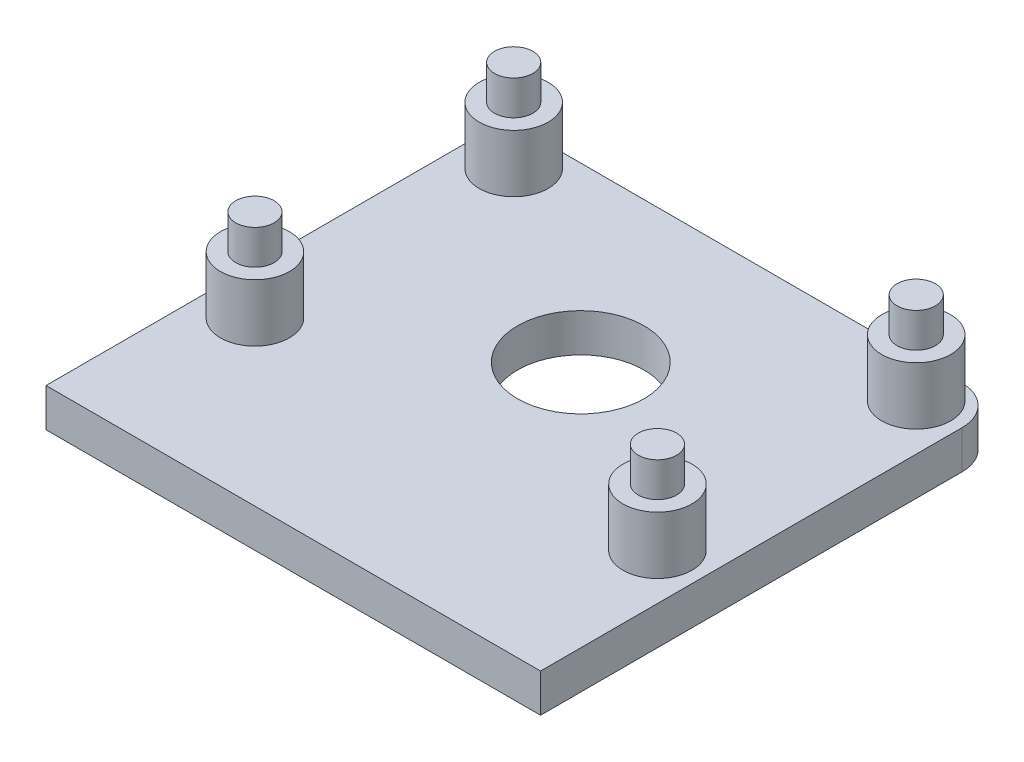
ISO-10303-21;
HEADER;
FILE_DESCRIPTION(('STEP AP214'),'2;1');
FILE_NAME('part.step','',(''),(''),'','','');
FILE_SCHEMA(('AUTOMOTIVE_DESIGN { 1 0 10303 214 1 1 1 1 }'));
ENDSEC;
DATA;
#1=APPLICATION_CONTEXT('core data for automotive mechanical design processes');
#2=APPLICATION_PROTOCOL_DEFINITION('international standard','automotive_design',2000,#1);
#3=PRODUCT_CONTEXT('',#1,'mechanical');
#4=PRODUCT('Part','Part','',(#3));
#5=PRODUCT_RELATED_PRODUCT_CATEGORY('part','',(#4));
#6=PRODUCT_DEFINITION_FORMATION('','',#4);
#7=PRODUCT_DEFINITION_CONTEXT('part definition',#1,'design');
#8=PRODUCT_DEFINITION('design','',#6,#7);
#9=PRODUCT_DEFINITION_SHAPE('','',#8);
#10=(LENGTH_UNIT() NAMED_UNIT(*) SI_UNIT(.MILLI.,.METRE.));
#11=(NAMED_UNIT(*) PLANE_ANGLE_UNIT() SI_UNIT($,.RADIAN.));
#12=(NAMED_UNIT(*) SI_UNIT($,.STERADIAN.) SOLID_ANGLE_UNIT());
#13=UNCERTAINTY_MEASURE_WITH_UNIT(LENGTH_MEASURE(1.E-05),#10,'distance_accuracy_value','');
#14=(GEOMETRIC_REPRESENTATION_CONTEXT(3) GLOBAL_UNCERTAINTY_ASSIGNED_CONTEXT((#13)) GLOBAL_UNIT_ASSIGNED_CONTEXT((#10,
#11,#12)) REPRESENTATION_CONTEXT('',''));
#15=CARTESIAN_POINT('',(0.,0.,0.));
#16=DIRECTION('',(0.,0.,1.));
#17=DIRECTION('',(1.,0.,0.));
#18=AXIS2_PLACEMENT_3D('',#15,#16,#17);
#19=CARTESIAN_POINT('',(0.,2.,0.));
#20=DIRECTION('',(0.,1.,0.));
#21=DIRECTION('',(0.,0.,1.));
#22=AXIS2_PLACEMENT_3D('',#19,#20,#21);
#23=PLANE('',#22);
#24=CARTESIAN_POINT('',(9.52951453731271,2.,0.378221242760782));
#25=DIRECTION('',(0.,1.,0.));
#26=DIRECTION('',(0.,0.,1.));
#27=AXIS2_PLACEMENT_3D('',#24,#25,#26);
#28=CIRCLE('',#27,1.8);
#29=CARTESIAN_POINT('',(9.52951453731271,2.,2.17822124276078));
#30=VERTEX_POINT('',#29);
#31=EDGE_CURVE('E160',#30,#30,#28,.T.);
#32=ORIENTED_EDGE('',*,*,#31,.F.);
#33=EDGE_LOOP('',(#32));
#34=FACE_BOUND('',#33,.T.);
#35=CARTESIAN_POINT('',(-11.4704854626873,2.,0.378221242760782));
#36=DIRECTION('',(0.,1.,0.));
#37=DIRECTION('',(0.,0.,1.));
#38=AXIS2_PLACEMENT_3D('',#35,#36,#37);
#39=CIRCLE('',#38,1.8);
#40=CARTESIAN_POINT('',(-11.4704854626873,2.,2.17822124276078));
#41=VERTEX_POINT('',#40);
#42=EDGE_CURVE('E153',#41,#41,#39,.T.);
#43=ORIENTED_EDGE('',*,*,#42,.F.);
#44=EDGE_LOOP('',(#43));
#45=FACE_BOUND('',#44,.T.);
#46=CARTESIAN_POINT('',(9.52951453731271,2.,-13.1217787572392));
#47=DIRECTION('',(0.,1.,0.));
#48=DIRECTION('',(0.,0.,1.));
#49=AXIS2_PLACEMENT_3D('',#46,#47,#48);
#50=CIRCLE('',#49,1.8);
#51=CARTESIAN_POINT('',(9.52951453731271,2.,-11.3217787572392));
#52=VERTEX_POINT('',#51);
#53=EDGE_CURVE('E146',#52,#52,#50,.T.);
#54=ORIENTED_EDGE('',*,*,#53,.F.);
#55=EDGE_LOOP('',(#54));
#56=FACE_BOUND('',#55,.T.);
#57=CARTESIAN_POINT('',(-11.4704854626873,2.,-13.1217787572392));
#58=DIRECTION('',(0.,1.,0.));
#59=DIRECTION('',(0.,0.,1.));
#60=AXIS2_PLACEMENT_3D('',#57,#58,#59);
#61=CIRCLE('',#60,1.8);
#62=CARTESIAN_POINT('',(-11.4704854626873,2.,-11.3217787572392));
#63=VERTEX_POINT('',#62);
#64=EDGE_CURVE('E142',#63,#63,#61,.T.);
#65=ORIENTED_EDGE('',*,*,#64,.F.);
#66=EDGE_LOOP('',(#65));
#67=FACE_BOUND('',#66,.T.);
#68=DIRECTION('',(0.,0.,-1.));
#69=VECTOR('',#68,1.);
#70=CARTESIAN_POINT('',(11.9295145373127,2.,-15.1217787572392));
#71=LINE('',#70,#69);
#72=CARTESIAN_POINT('',(11.9295145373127,2.,8.87822124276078));
#73=VERTEX_POINT('',#72);
#74=CARTESIAN_POINT('',(11.9295145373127,2.,-13.1217787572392));
#75=VERTEX_POINT('',#74);
#76=EDGE_CURVE('E122',#73,#75,#71,.T.);
#77=ORIENTED_EDGE('',*,*,#76,.T.);
#78=CARTESIAN_POINT('',(9.92951453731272,2.,-13.1217787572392));
#79=DIRECTION('',(0.,1.,0.));
#80=DIRECTION('',(0.,0.,1.));
#81=AXIS2_PLACEMENT_3D('',#78,#79,#80);
#82=CIRCLE('',#81,2.);
#83=CARTESIAN_POINT('',(9.92951453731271,2.,-15.1217787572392));
#84=VERTEX_POINT('',#83);
#85=EDGE_CURVE('E42',#75,#84,#82,.T.);
#86=ORIENTED_EDGE('',*,*,#85,.T.);
#87=DIRECTION('',(-1.,0.,0.));
#88=VECTOR('',#87,1.);
#89=CARTESIAN_POINT('',(-13.8704854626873,2.,-15.1217787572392));
#90=LINE('',#89,#88);
#91=CARTESIAN_POINT('',(-11.8704854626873,2.,-15.1217787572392));
#92=VERTEX_POINT('',#91);
#93=EDGE_CURVE('E96',#84,#92,#90,.T.);
#94=ORIENTED_EDGE('',*,*,#93,.T.);
#95=CARTESIAN_POINT('',(-11.8704854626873,2.,-13.1217787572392));
#96=DIRECTION('',(0.,1.,0.));
#97=DIRECTION('',(0.,0.,1.));
#98=AXIS2_PLACEMENT_3D('',#95,#96,#97);
#99=CIRCLE('',#98,2.);
#100=CARTESIAN_POINT('',(-13.8704854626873,2.,-13.1217787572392));
#101=VERTEX_POINT('',#100);
#102=EDGE_CURVE('E50',#92,#101,#99,.T.);
#103=ORIENTED_EDGE('',*,*,#102,.T.);
#104=DIRECTION('',(0.,0.,1.));
#105=VECTOR('',#104,1.);
#106=CARTESIAN_POINT('',(-13.8704854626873,2.,-15.1217787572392));
#107=LINE('',#106,#105);
#108=CARTESIAN_POINT('',(-13.8704854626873,2.,8.87822124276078));
#109=VERTEX_POINT('',#108);
#110=EDGE_CURVE('E88',#101,#109,#107,.T.);
#111=ORIENTED_EDGE('',*,*,#110,.T.);
#112=DIRECTION('',(1.,0.,0.));
#113=VECTOR('',#112,1.);
#114=CARTESIAN_POINT('',(-13.8704854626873,2.,8.87822124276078));
#115=LINE('',#114,#113);
#116=EDGE_CURVE('E92',#109,#73,#115,.T.);
#117=ORIENTED_EDGE('',*,*,#116,.T.);
#118=EDGE_LOOP('',(#77,#86,#94,#103,#111,#117));
#119=FACE_BOUND('',#118,.T.);
#120=CARTESIAN_POINT('',(-0.970485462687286,2.,-6.12177875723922));
#121=DIRECTION('',(0.,1.,0.));
#122=DIRECTION('',(0.,0.,1.));
#123=AXIS2_PLACEMENT_3D('',#120,#121,#122);
#124=CIRCLE('',#123,3.3);
#125=CARTESIAN_POINT('',(-0.970485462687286,2.,-2.82177875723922));
#126=VERTEX_POINT('',#125);
#127=EDGE_CURVE('E117',#126,#126,#124,.T.);
#128=ORIENTED_EDGE('',*,*,#127,.F.);
#129=EDGE_LOOP('',(#128));
#130=FACE_BOUND('',#129,.T.);
#131=ADVANCED_FACE('F33',(#34,#45,#56,#67,#119,#130),#23,.T.);
#132=CARTESIAN_POINT('',(0.,0.,0.));
#133=DIRECTION('',(0.,1.,0.));
#134=DIRECTION('',(0.,0.,1.));
#135=AXIS2_PLACEMENT_3D('',#132,#133,#134);
#136=PLANE('',#135);
#137=DIRECTION('',(-1.,0.,0.));
#138=VECTOR('',#137,1.);
#139=CARTESIAN_POINT('',(-13.8704854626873,0.,-15.1217787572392));
#140=LINE('',#139,#138);
#141=CARTESIAN_POINT('',(9.92951453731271,0.,-15.1217787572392));
#142=VERTEX_POINT('',#141);
#143=CARTESIAN_POINT('',(-11.8704854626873,0.,-15.1217787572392));
#144=VERTEX_POINT('',#143);
#145=EDGE_CURVE('E116',#142,#144,#140,.T.);
#146=ORIENTED_EDGE('',*,*,#145,.F.);
#147=CARTESIAN_POINT('',(9.92951453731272,0.,-13.1217787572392));
#148=DIRECTION('',(0.,1.,0.));
#149=DIRECTION('',(0.,0.,1.));
#150=AXIS2_PLACEMENT_3D('',#147,#148,#149);
#151=CIRCLE('',#150,2.);
#152=CARTESIAN_POINT('',(11.9295145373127,0.,-13.1217787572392));
#153=VERTEX_POINT('',#152);
#154=EDGE_CURVE('E130',#142,#153,#151,.F.);
#155=ORIENTED_EDGE('',*,*,#154,.T.);
#156=DIRECTION('',(0.,0.,-1.));
#157=VECTOR('',#156,1.);
#158=CARTESIAN_POINT('',(11.9295145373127,0.,-15.1217787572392));
#159=LINE('',#158,#157);
#160=CARTESIAN_POINT('',(11.9295145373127,0.,8.87822124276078));
#161=VERTEX_POINT('',#160);
#162=EDGE_CURVE('E114',#161,#153,#159,.T.);
#163=ORIENTED_EDGE('',*,*,#162,.F.);
#164=DIRECTION('',(1.,0.,0.));
#165=VECTOR('',#164,1.);
#166=CARTESIAN_POINT('',(-13.8704854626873,0.,8.87822124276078));
#167=LINE('',#166,#165);
#168=CARTESIAN_POINT('',(-13.8704854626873,0.,8.87822124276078));
#169=VERTEX_POINT('',#168);
#170=EDGE_CURVE('E121',#169,#161,#167,.T.);
#171=ORIENTED_EDGE('',*,*,#170,.F.);
#172=DIRECTION('',(0.,0.,1.));
#173=VECTOR('',#172,1.);
#174=CARTESIAN_POINT('',(-13.8704854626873,0.,-15.1217787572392));
#175=LINE('',#174,#173);
#176=CARTESIAN_POINT('',(-13.8704854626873,0.,-13.1217787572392));
#177=VERTEX_POINT('',#176);
#178=EDGE_CURVE('E102',#177,#169,#175,.T.);
#179=ORIENTED_EDGE('',*,*,#178,.F.);
#180=CARTESIAN_POINT('',(-11.8704854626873,0.,-13.1217787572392));
#181=DIRECTION('',(0.,1.,0.));
#182=DIRECTION('',(0.,0.,1.));
#183=AXIS2_PLACEMENT_3D('',#180,#181,#182);
#184=CIRCLE('',#183,2.);
#185=EDGE_CURVE('E128',#177,#144,#184,.F.);
#186=ORIENTED_EDGE('',*,*,#185,.T.);
#187=EDGE_LOOP('',(#146,#155,#163,#171,#179,#186));
#188=FACE_BOUND('',#187,.T.);
#189=CARTESIAN_POINT('',(-0.970485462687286,0.,-6.12177875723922));
#190=DIRECTION('',(0.,1.,0.));
#191=DIRECTION('',(0.,0.,1.));
#192=AXIS2_PLACEMENT_3D('',#189,#190,#191);
#193=CIRCLE('',#192,3.3);
#194=CARTESIAN_POINT('',(-0.970485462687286,0.,-2.82177875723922));
#195=VERTEX_POINT('',#194);
#196=EDGE_CURVE('E180',#195,#195,#193,.T.);
#197=ORIENTED_EDGE('',*,*,#196,.T.);
#198=EDGE_LOOP('',(#197));
#199=FACE_BOUND('',#198,.T.);
#200=ADVANCED_FACE('F193',(#188,#199),#136,.F.);
#201=CARTESIAN_POINT('',(11.9295145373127,2.,-15.1217787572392));
#202=DIRECTION('',(-1.,0.,0.));
#203=DIRECTION('',(0.,0.,1.));
#204=AXIS2_PLACEMENT_3D('',#201,#202,#203);
#205=PLANE('',#204);
#206=ORIENTED_EDGE('',*,*,#162,.T.);
#207=DIRECTION('',(0.,-1.,0.));
#208=VECTOR('',#207,1.);
#209=CARTESIAN_POINT('',(11.9295145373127,2.,-13.1217787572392));
#210=LINE('',#209,#208);
#211=EDGE_CURVE('E58',#153,#75,#210,.F.);
#212=ORIENTED_EDGE('',*,*,#211,.T.);
#213=ORIENTED_EDGE('',*,*,#76,.F.);
#214=DIRECTION('',(0.,-1.,0.));
#215=VECTOR('',#214,1.);
#216=CARTESIAN_POINT('',(11.9295145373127,2.,8.87822124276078));
#217=LINE('',#216,#215);
#218=EDGE_CURVE('E106',#73,#161,#217,.T.);
#219=ORIENTED_EDGE('',*,*,#218,.T.);
#220=EDGE_LOOP('',(#206,#212,#213,#219));
#221=FACE_BOUND('',#220,.T.);
#222=ADVANCED_FACE('F196',(#221),#205,.F.);
#223=CARTESIAN_POINT('',(-13.8704854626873,2.,-15.1217787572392));
#224=DIRECTION('',(0.,0.,1.));
#225=DIRECTION('',(1.,0.,0.));
#226=AXIS2_PLACEMENT_3D('',#223,#224,#225);
#227=PLANE('',#226);
#228=ORIENTED_EDGE('',*,*,#93,.F.);
#229=DIRECTION('',(0.,-1.,0.));
#230=VECTOR('',#229,1.);
#231=CARTESIAN_POINT('',(9.92951453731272,2.,-15.1217787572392));
#232=LINE('',#231,#230);
#233=EDGE_CURVE('E125',#84,#142,#232,.T.);
#234=ORIENTED_EDGE('',*,*,#233,.T.);
#235=ORIENTED_EDGE('',*,*,#145,.T.);
#236=DIRECTION('',(0.,-1.,0.));
#237=VECTOR('',#236,1.);
#238=CARTESIAN_POINT('',(-11.8704854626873,2.,-15.1217787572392));
#239=LINE('',#238,#237);
#240=EDGE_CURVE('E105',#144,#92,#239,.F.);
#241=ORIENTED_EDGE('',*,*,#240,.T.);
#242=EDGE_LOOP('',(#228,#234,#235,#241));
#243=FACE_BOUND('',#242,.T.);
#244=ADVANCED_FACE('F199',(#243),#227,.F.);
#245=CARTESIAN_POINT('',(-13.8704854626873,2.,-15.1217787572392));
#246=DIRECTION('',(1.,0.,0.));
#247=DIRECTION('',(0.,0.,-1.));
#248=AXIS2_PLACEMENT_3D('',#245,#246,#247);
#249=PLANE('',#248);
#250=ORIENTED_EDGE('',*,*,#110,.F.);
#251=DIRECTION('',(0.,-1.,0.));
#252=VECTOR('',#251,1.);
#253=CARTESIAN_POINT('',(-13.8704854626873,2.,-13.1217787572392));
#254=LINE('',#253,#252);
#255=EDGE_CURVE('E11',#101,#177,#254,.T.);
#256=ORIENTED_EDGE('',*,*,#255,.T.);
#257=ORIENTED_EDGE('',*,*,#178,.T.);
#258=DIRECTION('',(0.,-1.,0.));
#259=VECTOR('',#258,1.);
#260=CARTESIAN_POINT('',(-13.8704854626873,2.,8.87822124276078));
#261=LINE('',#260,#259);
#262=EDGE_CURVE('E99',#109,#169,#261,.T.);
#263=ORIENTED_EDGE('',*,*,#262,.F.);
#264=EDGE_LOOP('',(#250,#256,#257,#263));
#265=FACE_BOUND('',#264,.T.);
#266=ADVANCED_FACE('F100',(#265),#249,.F.);
#267=CARTESIAN_POINT('',(-13.8704854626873,2.,8.87822124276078));
#268=DIRECTION('',(0.,0.,-1.));
#269=DIRECTION('',(-1.,0.,0.));
#270=AXIS2_PLACEMENT_3D('',#267,#268,#269);
#271=PLANE('',#270);
#272=ORIENTED_EDGE('',*,*,#170,.T.);
#273=ORIENTED_EDGE('',*,*,#218,.F.);
#274=ORIENTED_EDGE('',*,*,#116,.F.);
#275=ORIENTED_EDGE('',*,*,#262,.T.);
#276=EDGE_LOOP('',(#272,#273,#274,#275));
#277=FACE_BOUND('',#276,.T.);
#278=ADVANCED_FACE('F108',(#277),#271,.F.);
#279=CARTESIAN_POINT('',(-0.970485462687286,2.,-6.12177875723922));
#280=DIRECTION('',(0.,-1.,0.));
#281=DIRECTION('',(0.,0.,-1.));
#282=AXIS2_PLACEMENT_3D('',#279,#280,#281);
#283=CYLINDRICAL_SURFACE('',#282,3.3);
#284=ORIENTED_EDGE('',*,*,#127,.T.);
#285=EDGE_LOOP('',(#284));
#286=FACE_BOUND('',#285,.T.);
#287=ORIENTED_EDGE('',*,*,#196,.F.);
#288=EDGE_LOOP('',(#287));
#289=FACE_BOUND('',#288,.T.);
#290=ADVANCED_FACE('F220',(#286,#289),#283,.F.);
#291=CARTESIAN_POINT('',(9.92951453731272,2.,-13.1217787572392));
#292=DIRECTION('',(0.,-1.,0.));
#293=DIRECTION('',(0.,0.,-1.));
#294=AXIS2_PLACEMENT_3D('',#291,#292,#293);
#295=CYLINDRICAL_SURFACE('',#294,2.);
#296=ORIENTED_EDGE('',*,*,#85,.F.);
#297=ORIENTED_EDGE('',*,*,#211,.F.);
#298=ORIENTED_EDGE('',*,*,#154,.F.);
#299=ORIENTED_EDGE('',*,*,#233,.F.);
#300=EDGE_LOOP('',(#296,#297,#298,#299));
#301=FACE_BOUND('',#300,.T.);
#302=ADVANCED_FACE('F198',(#301),#295,.T.);
#303=CARTESIAN_POINT('',(-11.8704854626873,2.,-13.1217787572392));
#304=DIRECTION('',(0.,-1.,0.));
#305=DIRECTION('',(0.,0.,-1.));
#306=AXIS2_PLACEMENT_3D('',#303,#304,#305);
#307=CYLINDRICAL_SURFACE('',#306,2.);
#308=ORIENTED_EDGE('',*,*,#102,.F.);
#309=ORIENTED_EDGE('',*,*,#240,.F.);
#310=ORIENTED_EDGE('',*,*,#185,.F.);
#311=ORIENTED_EDGE('',*,*,#255,.F.);
#312=EDGE_LOOP('',(#308,#309,#310,#311));
#313=FACE_BOUND('',#312,.T.);
#314=ADVANCED_FACE('F35',(#313),#307,.T.);
#315=CARTESIAN_POINT('',(-11.4704854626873,5.,-13.1217787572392));
#316=DIRECTION('',(0.,-1.,0.));
#317=DIRECTION('',(0.,0.,-1.));
#318=AXIS2_PLACEMENT_3D('',#315,#316,#317);
#319=CYLINDRICAL_SURFACE('',#318,1.8);
#320=CARTESIAN_POINT('',(-11.4704854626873,5.,-13.1217787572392));
#321=DIRECTION('',(0.,1.,0.));
#322=DIRECTION('',(0.,0.,1.));
#323=AXIS2_PLACEMENT_3D('',#320,#321,#322);
#324=CIRCLE('',#323,1.8);
#325=CARTESIAN_POINT('',(-11.4704854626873,5.,-11.3217787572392));
#326=VERTEX_POINT('',#325);
#327=EDGE_CURVE('E139',#326,#326,#324,.T.);
#328=ORIENTED_EDGE('',*,*,#327,.F.);
#329=EDGE_LOOP('',(#328));
#330=FACE_BOUND('',#329,.T.);
#331=ORIENTED_EDGE('',*,*,#64,.T.);
#332=EDGE_LOOP('',(#331));
#333=FACE_BOUND('',#332,.T.);
#334=ADVANCED_FACE('F239',(#330,#333),#319,.T.);
#335=CARTESIAN_POINT('',(-11.4704854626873,5.,-13.1217787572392));
#336=DIRECTION('',(0.,1.,0.));
#337=DIRECTION('',(0.,0.,1.));
#338=AXIS2_PLACEMENT_3D('',#335,#336,#337);
#339=PLANE('',#338);
#340=CARTESIAN_POINT('',(-11.4704854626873,5.,-13.1217787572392));
#341=DIRECTION('',(0.,1.,0.));
#342=DIRECTION('',(0.,0.,1.));
#343=AXIS2_PLACEMENT_3D('',#340,#341,#342);
#344=CIRCLE('',#343,1.);
#345=CARTESIAN_POINT('',(-11.4704854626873,5.,-12.1217787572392));
#346=VERTEX_POINT('',#345);
#347=EDGE_CURVE('E135',#346,#346,#344,.T.);
#348=ORIENTED_EDGE('',*,*,#347,.F.);
#349=EDGE_LOOP('',(#348));
#350=FACE_BOUND('',#349,.T.);
#351=ORIENTED_EDGE('',*,*,#327,.T.);
#352=EDGE_LOOP('',(#351));
#353=FACE_BOUND('',#352,.T.);
#354=ADVANCED_FACE('F242',(#350,#353),#339,.T.);
#355=CARTESIAN_POINT('',(-11.4704854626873,6.8,-13.1217787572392));
#356=DIRECTION('',(0.,1.,0.));
#357=DIRECTION('',(0.,0.,1.));
#358=AXIS2_PLACEMENT_3D('',#355,#356,#357);
#359=PLANE('',#358);
#360=CARTESIAN_POINT('',(-11.4704854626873,6.8,-13.1217787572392));
#361=DIRECTION('',(0.,1.,0.));
#362=DIRECTION('',(0.,0.,1.));
#363=AXIS2_PLACEMENT_3D('',#360,#361,#362);
#364=CIRCLE('',#363,1.);
#365=CARTESIAN_POINT('',(-11.4704854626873,6.8,-12.1217787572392));
#366=VERTEX_POINT('',#365);
#367=EDGE_CURVE('E177',#366,#366,#364,.T.);
#368=ORIENTED_EDGE('',*,*,#367,.T.);
#369=EDGE_LOOP('',(#368));
#370=FACE_BOUND('',#369,.T.);
#371=ADVANCED_FACE('F247',(#370),#359,.T.);
#372=CARTESIAN_POINT('',(-11.4704854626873,6.8,-13.1217787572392));
#373=DIRECTION('',(0.,-1.,0.));
#374=DIRECTION('',(0.,0.,-1.));
#375=AXIS2_PLACEMENT_3D('',#372,#373,#374);
#376=CYLINDRICAL_SURFACE('',#375,1.);
#377=ORIENTED_EDGE('',*,*,#347,.T.);
#378=EDGE_LOOP('',(#377));
#379=FACE_BOUND('',#378,.T.);
#380=ORIENTED_EDGE('',*,*,#367,.F.);
#381=EDGE_LOOP('',(#380));
#382=FACE_BOUND('',#381,.T.);
#383=ADVANCED_FACE('F282',(#379,#382),#376,.T.);
#384=CARTESIAN_POINT('',(9.52951453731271,5.,-13.1217787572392));
#385=DIRECTION('',(0.,-1.,0.));
#386=DIRECTION('',(0.,0.,-1.));
#387=AXIS2_PLACEMENT_3D('',#384,#385,#386);
#388=CYLINDRICAL_SURFACE('',#387,1.8);
#389=CARTESIAN_POINT('',(9.52951453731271,5.,-13.1217787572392));
#390=DIRECTION('',(0.,1.,0.));
#391=DIRECTION('',(0.,0.,1.));
#392=AXIS2_PLACEMENT_3D('',#389,#390,#391);
#393=CIRCLE('',#392,1.8);
#394=CARTESIAN_POINT('',(9.52951453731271,5.,-11.3217787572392));
#395=VERTEX_POINT('',#394);
#396=EDGE_CURVE('E143',#395,#395,#393,.T.);
#397=ORIENTED_EDGE('',*,*,#396,.F.);
#398=EDGE_LOOP('',(#397));
#399=FACE_BOUND('',#398,.T.);
#400=ORIENTED_EDGE('',*,*,#53,.T.);
#401=EDGE_LOOP('',(#400));
#402=FACE_BOUND('',#401,.T.);
#403=ADVANCED_FACE('F285',(#399,#402),#388,.T.);
#404=CARTESIAN_POINT('',(9.52951453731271,5.,-13.1217787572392));
#405=DIRECTION('',(0.,1.,0.));
#406=DIRECTION('',(0.,0.,1.));
#407=AXIS2_PLACEMENT_3D('',#404,#405,#406);
#408=PLANE('',#407);
#409=CARTESIAN_POINT('',(9.52951453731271,5.,-13.1217787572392));
#410=DIRECTION('',(0.,1.,0.));
#411=DIRECTION('',(0.,0.,1.));
#412=AXIS2_PLACEMENT_3D('',#409,#410,#411);
#413=CIRCLE('',#412,1.);
#414=CARTESIAN_POINT('',(9.52951453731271,5.,-12.1217787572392));
#415=VERTEX_POINT('',#414);
#416=EDGE_CURVE('E140',#415,#415,#413,.T.);
#417=ORIENTED_EDGE('',*,*,#416,.F.);
#418=EDGE_LOOP('',(#417));
#419=FACE_BOUND('',#418,.T.);
#420=ORIENTED_EDGE('',*,*,#396,.T.);
#421=EDGE_LOOP('',(#420));
#422=FACE_BOUND('',#421,.T.);
#423=ADVANCED_FACE('F275',(#419,#422),#408,.T.);
#424=CARTESIAN_POINT('',(9.52951453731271,6.8,-13.1217787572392));
#425=DIRECTION('',(0.,1.,0.));
#426=DIRECTION('',(0.,0.,1.));
#427=AXIS2_PLACEMENT_3D('',#424,#425,#426);
#428=PLANE('',#427);
#429=CARTESIAN_POINT('',(9.52951453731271,6.8,-13.1217787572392));
#430=DIRECTION('',(0.,1.,0.));
#431=DIRECTION('',(0.,0.,1.));
#432=AXIS2_PLACEMENT_3D('',#429,#430,#431);
#433=CIRCLE('',#432,1.);
#434=CARTESIAN_POINT('',(9.52951453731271,6.8,-12.1217787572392));
#435=VERTEX_POINT('',#434);
#436=EDGE_CURVE('E174',#435,#435,#433,.T.);
#437=ORIENTED_EDGE('',*,*,#436,.T.);
#438=EDGE_LOOP('',(#437));
#439=FACE_BOUND('',#438,.T.);
#440=ADVANCED_FACE('F271',(#439),#428,.T.);
#441=CARTESIAN_POINT('',(9.52951453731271,6.8,-13.1217787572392));
#442=DIRECTION('',(0.,-1.,0.));
#443=DIRECTION('',(0.,0.,-1.));
#444=AXIS2_PLACEMENT_3D('',#441,#442,#443);
#445=CYLINDRICAL_SURFACE('',#444,1.);
#446=ORIENTED_EDGE('',*,*,#416,.T.);
#447=EDGE_LOOP('',(#446));
#448=FACE_BOUND('',#447,.T.);
#449=ORIENTED_EDGE('',*,*,#436,.F.);
#450=EDGE_LOOP('',(#449));
#451=FACE_BOUND('',#450,.T.);
#452=ADVANCED_FACE('F274',(#448,#451),#445,.T.);
#453=CARTESIAN_POINT('',(-11.4704854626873,5.,0.378221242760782));
#454=DIRECTION('',(0.,-1.,0.));
#455=DIRECTION('',(0.,0.,-1.));
#456=AXIS2_PLACEMENT_3D('',#453,#454,#455);
#457=CYLINDRICAL_SURFACE('',#456,1.8);
#458=CARTESIAN_POINT('',(-11.4704854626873,5.,0.378221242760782));
#459=DIRECTION('',(0.,1.,0.));
#460=DIRECTION('',(0.,0.,1.));
#461=AXIS2_PLACEMENT_3D('',#458,#459,#460);
#462=CIRCLE('',#461,1.8);
#463=CARTESIAN_POINT('',(-11.4704854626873,5.,2.17822124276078));
#464=VERTEX_POINT('',#463);
#465=EDGE_CURVE('E147',#464,#464,#462,.T.);
#466=ORIENTED_EDGE('',*,*,#465,.F.);
#467=EDGE_LOOP('',(#466));
#468=FACE_BOUND('',#467,.T.);
#469=ORIENTED_EDGE('',*,*,#42,.T.);
#470=EDGE_LOOP('',(#469));
#471=FACE_BOUND('',#470,.T.);
#472=ADVANCED_FACE('F279',(#468,#471),#457,.T.);
#473=CARTESIAN_POINT('',(-11.4704854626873,5.,0.378221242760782));
#474=DIRECTION('',(0.,1.,0.));
#475=DIRECTION('',(0.,0.,1.));
#476=AXIS2_PLACEMENT_3D('',#473,#474,#475);
#477=PLANE('',#476);
#478=CARTESIAN_POINT('',(-11.4704854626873,5.,0.378221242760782));
#479=DIRECTION('',(0.,1.,0.));
#480=DIRECTION('',(0.,0.,1.));
#481=AXIS2_PLACEMENT_3D('',#478,#479,#480);
#482=CIRCLE('',#481,1.);
#483=CARTESIAN_POINT('',(-11.4704854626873,5.,1.37822124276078));
#484=VERTEX_POINT('',#483);
#485=EDGE_CURVE('E144',#484,#484,#482,.T.);
#486=ORIENTED_EDGE('',*,*,#485,.F.);
#487=EDGE_LOOP('',(#486));
#488=FACE_BOUND('',#487,.T.);
#489=ORIENTED_EDGE('',*,*,#465,.T.);
#490=EDGE_LOOP('',(#489));
#491=FACE_BOUND('',#490,.T.);
#492=ADVANCED_FACE('F266',(#488,#491),#477,.T.);
#493=CARTESIAN_POINT('',(-11.4704854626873,6.8,0.378221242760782));
#494=DIRECTION('',(0.,1.,0.));
#495=DIRECTION('',(0.,0.,1.));
#496=AXIS2_PLACEMENT_3D('',#493,#494,#495);
#497=PLANE('',#496);
#498=CARTESIAN_POINT('',(-11.4704854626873,6.8,0.378221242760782));
#499=DIRECTION('',(0.,1.,0.));
#500=DIRECTION('',(0.,0.,1.));
#501=AXIS2_PLACEMENT_3D('',#498,#499,#500);
#502=CIRCLE('',#501,1.);
#503=CARTESIAN_POINT('',(-11.4704854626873,6.8,1.37822124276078));
#504=VERTEX_POINT('',#503);
#505=EDGE_CURVE('E171',#504,#504,#502,.T.);
#506=ORIENTED_EDGE('',*,*,#505,.T.);
#507=EDGE_LOOP('',(#506));
#508=FACE_BOUND('',#507,.T.);
#509=ADVANCED_FACE('F262',(#508),#497,.T.);
#510=CARTESIAN_POINT('',(-11.4704854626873,6.8,0.378221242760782));
#511=DIRECTION('',(0.,-1.,0.));
#512=DIRECTION('',(0.,0.,-1.));
#513=AXIS2_PLACEMENT_3D('',#510,#511,#512);
#514=CYLINDRICAL_SURFACE('',#513,1.);
#515=ORIENTED_EDGE('',*,*,#485,.T.);
#516=EDGE_LOOP('',(#515));
#517=FACE_BOUND('',#516,.T.);
#518=ORIENTED_EDGE('',*,*,#505,.F.);
#519=EDGE_LOOP('',(#518));
#520=FACE_BOUND('',#519,.T.);
#521=ADVANCED_FACE('F265',(#517,#520),#514,.T.);
#522=CARTESIAN_POINT('',(9.52951453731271,5.,0.378221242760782));
#523=DIRECTION('',(0.,-1.,0.));
#524=DIRECTION('',(0.,0.,-1.));
#525=AXIS2_PLACEMENT_3D('',#522,#523,#524);
#526=CYLINDRICAL_SURFACE('',#525,1.8);
#527=CARTESIAN_POINT('',(9.52951453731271,5.,0.378221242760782));
#528=DIRECTION('',(0.,1.,0.));
#529=DIRECTION('',(0.,0.,1.));
#530=AXIS2_PLACEMENT_3D('',#527,#528,#529);
#531=CIRCLE('',#530,1.8);
#532=CARTESIAN_POINT('',(9.52951453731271,5.,2.17822124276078));
#533=VERTEX_POINT('',#532);
#534=EDGE_CURVE('E321',#533,#533,#531,.T.);
#535=ORIENTED_EDGE('',*,*,#534,.F.);
#536=EDGE_LOOP('',(#535));
#537=FACE_BOUND('',#536,.T.);
#538=ORIENTED_EDGE('',*,*,#31,.T.);
#539=EDGE_LOOP('',(#538));
#540=FACE_BOUND('',#539,.T.);
#541=ADVANCED_FACE('F270',(#537,#540),#526,.T.);
#542=CARTESIAN_POINT('',(9.52951453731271,5.,0.378221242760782));
#543=DIRECTION('',(0.,1.,0.));
#544=DIRECTION('',(0.,0.,1.));
#545=AXIS2_PLACEMENT_3D('',#542,#543,#544);
#546=PLANE('',#545);
#547=CARTESIAN_POINT('',(9.52951453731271,5.,0.378221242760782));
#548=DIRECTION('',(0.,1.,0.));
#549=DIRECTION('',(0.,0.,1.));
#550=AXIS2_PLACEMENT_3D('',#547,#548,#549);
#551=CIRCLE('',#550,1.);
#552=CARTESIAN_POINT('',(9.52951453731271,5.,1.37822124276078));
#553=VERTEX_POINT('',#552);
#554=EDGE_CURVE('E37',#553,#553,#551,.T.);
#555=ORIENTED_EDGE('',*,*,#554,.F.);
#556=EDGE_LOOP('',(#555));
#557=FACE_BOUND('',#556,.T.);
#558=ORIENTED_EDGE('',*,*,#534,.T.);
#559=EDGE_LOOP('',(#558));
#560=FACE_BOUND('',#559,.T.);
#561=ADVANCED_FACE('F257',(#557,#560),#546,.T.);
#562=CARTESIAN_POINT('',(9.52951453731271,6.8,0.378221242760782));
#563=DIRECTION('',(0.,1.,0.));
#564=DIRECTION('',(0.,0.,1.));
#565=AXIS2_PLACEMENT_3D('',#562,#563,#564);
#566=PLANE('',#565);
#567=CARTESIAN_POINT('',(9.52951453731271,6.8,0.378221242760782));
#568=DIRECTION('',(0.,1.,0.));
#569=DIRECTION('',(0.,0.,1.));
#570=AXIS2_PLACEMENT_3D('',#567,#568,#569);
#571=CIRCLE('',#570,1.);
#572=CARTESIAN_POINT('',(9.52951453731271,6.8,1.37822124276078));
#573=VERTEX_POINT('',#572);
#574=EDGE_CURVE('E138',#573,#573,#571,.T.);
#575=ORIENTED_EDGE('',*,*,#574,.T.);
#576=EDGE_LOOP('',(#575));
#577=FACE_BOUND('',#576,.T.);
#578=ADVANCED_FACE('F254',(#577),#566,.T.);
#579=CARTESIAN_POINT('',(9.52951453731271,6.8,0.378221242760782));
#580=DIRECTION('',(0.,-1.,0.));
#581=DIRECTION('',(0.,0.,-1.));
#582=AXIS2_PLACEMENT_3D('',#579,#580,#581);
#583=CYLINDRICAL_SURFACE('',#582,1.);
#584=ORIENTED_EDGE('',*,*,#554,.T.);
#585=EDGE_LOOP('',(#584));
#586=FACE_BOUND('',#585,.T.);
#587=ORIENTED_EDGE('',*,*,#574,.F.);
#588=EDGE_LOOP('',(#587));
#589=FACE_BOUND('',#588,.T.);
#590=ADVANCED_FACE('F256',(#586,#589),#583,.T.);
#591=CLOSED_SHELL('',(#131,#200,#222,#244,#266,#278,#290,#302,#314,#334,#354,#371,#383,#403,
#423,#440,#452,#472,#492,#509,#521,#541,#561,#578,#590));
#592=MANIFOLD_SOLID_BREP('B2',#591);
#593=ADVANCED_BREP_SHAPE_REPRESENTATION('',(#18,#592),#14);
#594=SHAPE_DEFINITION_REPRESENTATION(#9,#593);
ENDSEC;
END-ISO-10303-21;
